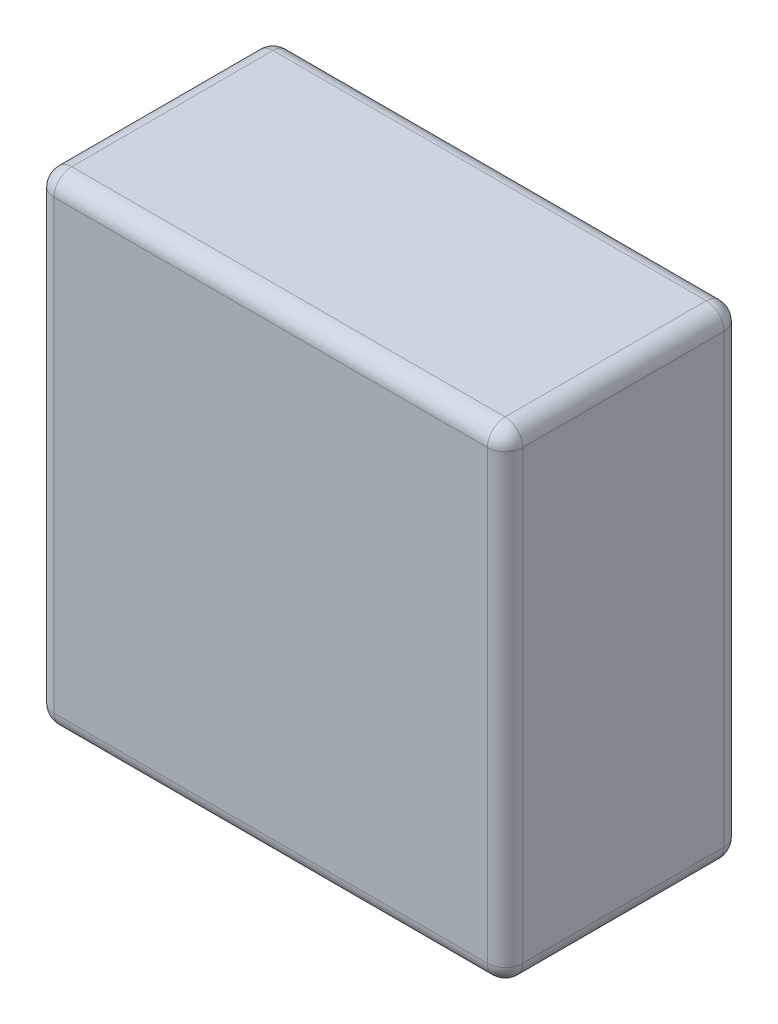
ISO-10303-21;
HEADER;
FILE_DESCRIPTION(('STEP AP214'),'2;1');
FILE_NAME('part.step','',(''),(''),'','','');
FILE_SCHEMA(('AUTOMOTIVE_DESIGN { 1 0 10303 214 1 1 1 1 }'));
ENDSEC;
DATA;
#1=APPLICATION_CONTEXT('core data for automotive mechanical design processes');
#2=APPLICATION_PROTOCOL_DEFINITION('international standard','automotive_design',2000,#1);
#3=PRODUCT_CONTEXT('',#1,'mechanical');
#4=PRODUCT('Part','Part','',(#3));
#5=PRODUCT_RELATED_PRODUCT_CATEGORY('part','',(#4));
#6=PRODUCT_DEFINITION_FORMATION('','',#4);
#7=PRODUCT_DEFINITION_CONTEXT('part definition',#1,'design');
#8=PRODUCT_DEFINITION('design','',#6,#7);
#9=PRODUCT_DEFINITION_SHAPE('','',#8);
#10=(LENGTH_UNIT() NAMED_UNIT(*) SI_UNIT(.MILLI.,.METRE.));
#11=(NAMED_UNIT(*) PLANE_ANGLE_UNIT() SI_UNIT($,.RADIAN.));
#12=(NAMED_UNIT(*) SI_UNIT($,.STERADIAN.) SOLID_ANGLE_UNIT());
#13=UNCERTAINTY_MEASURE_WITH_UNIT(LENGTH_MEASURE(1.E-05),#10,'distance_accuracy_value','');
#14=(GEOMETRIC_REPRESENTATION_CONTEXT(3) GLOBAL_UNCERTAINTY_ASSIGNED_CONTEXT((#13)) GLOBAL_UNIT_ASSIGNED_CONTEXT((#10,
#11,#12)) REPRESENTATION_CONTEXT('',''));
#15=CARTESIAN_POINT('',(0.,0.,0.));
#16=DIRECTION('',(0.,0.,1.));
#17=DIRECTION('',(1.,0.,0.));
#18=AXIS2_PLACEMENT_3D('',#15,#16,#17);
#19=CARTESIAN_POINT('',(341.,36.,106.));
#20=DIRECTION('',(1.,0.,0.));
#21=DIRECTION('',(0.,1.,0.));
#22=AXIS2_PLACEMENT_3D('',#19,#20,#21);
#23=SPHERICAL_SURFACE('',#22,4.);
#24=CARTESIAN_POINT('',(341.,36.,106.));
#25=DIRECTION('',(1.,0.,0.));
#26=DIRECTION('',(0.,0.,-1.));
#27=AXIS2_PLACEMENT_3D('',#24,#25,#26);
#28=CIRCLE('',#27,4.);
#29=CARTESIAN_POINT('',(341.,32.,106.));
#30=VERTEX_POINT('',#29);
#31=CARTESIAN_POINT('',(341.,35.9999999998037,102.));
#32=VERTEX_POINT('',#31);
#33=EDGE_CURVE('E120',#30,#32,#28,.T.);
#34=ORIENTED_EDGE('',*,*,#33,.F.);
#35=CARTESIAN_POINT('',(341.,36.,106.));
#36=DIRECTION('',(0.,0.,1.));
#37=DIRECTION('',(1.,0.,0.));
#38=AXIS2_PLACEMENT_3D('',#35,#36,#37);
#39=CIRCLE('',#38,4.);
#40=CARTESIAN_POINT('',(337.,36.,106.));
#41=VERTEX_POINT('',#40);
#42=EDGE_CURVE('E123',#41,#30,#39,.T.);
#43=ORIENTED_EDGE('',*,*,#42,.F.);
#44=CARTESIAN_POINT('',(341.,36.,106.));
#45=DIRECTION('',(0.,1.,0.));
#46=DIRECTION('',(1.,0.,0.));
#47=AXIS2_PLACEMENT_3D('',#44,#45,#46);
#48=CIRCLE('',#47,4.);
#49=EDGE_CURVE('E117',#32,#41,#48,.T.);
#50=ORIENTED_EDGE('',*,*,#49,.F.);
#51=EDGE_LOOP('',(#34,#43,#50));
#52=FACE_BOUND('',#51,.T.);
#53=ADVANCED_FACE('F16',(#52),#23,.T.);
#54=CARTESIAN_POINT('',(341.,36.,106.));
#55=DIRECTION('',(0.,1.,0.));
#56=DIRECTION('',(0.,0.,1.));
#57=AXIS2_PLACEMENT_3D('',#54,#55,#56);
#58=CYLINDRICAL_SURFACE('',#57,4.);
#59=DIRECTION('',(0.,1.,0.));
#60=VECTOR('',#59,1.);
#61=CARTESIAN_POINT('',(341.,86.5,102.));
#62=LINE('',#61,#60);
#63=CARTESIAN_POINT('',(341.,137.,102.));
#64=VERTEX_POINT('',#63);
#65=EDGE_CURVE('E129',#64,#32,#62,.F.);
#66=ORIENTED_EDGE('',*,*,#65,.T.);
#67=ORIENTED_EDGE('',*,*,#49,.T.);
#68=DIRECTION('',(0.,1.,0.));
#69=VECTOR('',#68,1.);
#70=CARTESIAN_POINT('',(337.,86.5,106.));
#71=LINE('',#70,#69);
#72=CARTESIAN_POINT('',(337.,137.,106.));
#73=VERTEX_POINT('',#72);
#74=EDGE_CURVE('E535',#41,#73,#71,.T.);
#75=ORIENTED_EDGE('',*,*,#74,.T.);
#76=CARTESIAN_POINT('',(341.,137.,106.));
#77=DIRECTION('',(0.,1.,0.));
#78=DIRECTION('',(1.,0.,0.));
#79=AXIS2_PLACEMENT_3D('',#76,#77,#78);
#80=CIRCLE('',#79,4.);
#81=EDGE_CURVE('E132',#64,#73,#80,.T.);
#82=ORIENTED_EDGE('',*,*,#81,.F.);
#83=EDGE_LOOP('',(#66,#67,#75,#82));
#84=FACE_BOUND('',#83,.T.);
#85=ADVANCED_FACE('F130',(#84),#58,.T.);
#86=CARTESIAN_POINT('',(341.,36.,106.));
#87=DIRECTION('',(1.,0.,0.));
#88=DIRECTION('',(0.,0.,-1.));
#89=AXIS2_PLACEMENT_3D('',#86,#87,#88);
#90=CYLINDRICAL_SURFACE('',#89,4.);
#91=DIRECTION('',(1.,0.,0.));
#92=VECTOR('',#91,1.);
#93=CARTESIAN_POINT('',(390.,36.,102.));
#94=LINE('',#93,#92);
#95=CARTESIAN_POINT('',(439.,36.,102.));
#96=VERTEX_POINT('',#95);
#97=EDGE_CURVE('E136',#32,#96,#94,.T.);
#98=ORIENTED_EDGE('',*,*,#97,.T.);
#99=CARTESIAN_POINT('',(439.,36.,106.));
#100=DIRECTION('',(1.,0.,0.));
#101=DIRECTION('',(0.,1.,0.));
#102=AXIS2_PLACEMENT_3D('',#99,#100,#101);
#103=CIRCLE('',#102,4.);
#104=CARTESIAN_POINT('',(439.,32.,106.));
#105=VERTEX_POINT('',#104);
#106=EDGE_CURVE('E137',#105,#96,#103,.T.);
#107=ORIENTED_EDGE('',*,*,#106,.F.);
#108=DIRECTION('',(1.,0.,0.));
#109=VECTOR('',#108,1.);
#110=CARTESIAN_POINT('',(390.,32.,106.));
#111=LINE('',#110,#109);
#112=EDGE_CURVE('E143',#105,#30,#111,.F.);
#113=ORIENTED_EDGE('',*,*,#112,.T.);
#114=ORIENTED_EDGE('',*,*,#33,.T.);
#115=EDGE_LOOP('',(#98,#107,#113,#114));
#116=FACE_BOUND('',#115,.T.);
#117=ADVANCED_FACE('F140',(#116),#90,.T.);
#118=CARTESIAN_POINT('',(341.,36.,106.));
#119=DIRECTION('',(0.,0.,1.));
#120=DIRECTION('',(1.,0.,0.));
#121=AXIS2_PLACEMENT_3D('',#118,#119,#120);
#122=CYLINDRICAL_SURFACE('',#121,4.);
#123=DIRECTION('',(0.,0.,1.));
#124=VECTOR('',#123,1.);
#125=CARTESIAN_POINT('',(341.,32.,128.75));
#126=LINE('',#125,#124);
#127=CARTESIAN_POINT('',(341.,32.,151.499999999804));
#128=VERTEX_POINT('',#127);
#129=EDGE_CURVE('E188',#30,#128,#126,.T.);
#130=ORIENTED_EDGE('',*,*,#129,.T.);
#131=CARTESIAN_POINT('',(341.,36.,151.5));
#132=DIRECTION('',(0.,3.92521448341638E-10,-1.));
#133=DIRECTION('',(1.,0.,0.));
#134=AXIS2_PLACEMENT_3D('',#131,#132,#133);
#135=CIRCLE('',#134,4.);
#136=CARTESIAN_POINT('',(337.,36.,151.5));
#137=VERTEX_POINT('',#136);
#138=EDGE_CURVE('E184',#137,#128,#135,.F.);
#139=ORIENTED_EDGE('',*,*,#138,.F.);
#140=DIRECTION('',(0.,0.,-1.));
#141=VECTOR('',#140,1.);
#142=CARTESIAN_POINT('',(337.,36.,128.75));
#143=LINE('',#142,#141);
#144=EDGE_CURVE('E151',#137,#41,#143,.T.);
#145=ORIENTED_EDGE('',*,*,#144,.T.);
#146=ORIENTED_EDGE('',*,*,#42,.T.);
#147=EDGE_LOOP('',(#130,#139,#145,#146));
#148=FACE_BOUND('',#147,.T.);
#149=ADVANCED_FACE('F351',(#148),#122,.T.);
#150=CARTESIAN_POINT('',(439.,36.,106.));
#151=DIRECTION('',(1.,0.,0.));
#152=DIRECTION('',(0.,1.,0.));
#153=AXIS2_PLACEMENT_3D('',#150,#151,#152);
#154=SPHERICAL_SURFACE('',#153,4.);
#155=CARTESIAN_POINT('',(439.,36.,106.));
#156=DIRECTION('',(0.,0.,1.));
#157=DIRECTION('',(1.,0.,0.));
#158=AXIS2_PLACEMENT_3D('',#155,#156,#157);
#159=CIRCLE('',#158,4.);
#160=CARTESIAN_POINT('',(443.,36.,106.));
#161=VERTEX_POINT('',#160);
#162=EDGE_CURVE('E189',#105,#161,#159,.T.);
#163=ORIENTED_EDGE('',*,*,#162,.F.);
#164=ORIENTED_EDGE('',*,*,#106,.T.);
#165=CARTESIAN_POINT('',(439.,36.,106.));
#166=DIRECTION('',(0.,1.,0.));
#167=DIRECTION('',(1.,0.,0.));
#168=AXIS2_PLACEMENT_3D('',#165,#166,#167);
#169=CIRCLE('',#168,4.);
#170=EDGE_CURVE('E192',#161,#96,#169,.T.);
#171=ORIENTED_EDGE('',*,*,#170,.F.);
#172=EDGE_LOOP('',(#163,#164,#171));
#173=FACE_BOUND('',#172,.T.);
#174=ADVANCED_FACE('F345',(#173),#154,.T.);
#175=CARTESIAN_POINT('',(390.,86.5,102.));
#176=DIRECTION('',(0.,0.,1.));
#177=DIRECTION('',(1.,0.,0.));
#178=AXIS2_PLACEMENT_3D('',#175,#176,#177);
#179=PLANE('',#178);
#180=ORIENTED_EDGE('',*,*,#97,.F.);
#181=ORIENTED_EDGE('',*,*,#65,.F.);
#182=DIRECTION('',(1.,0.,0.));
#183=VECTOR('',#182,1.);
#184=CARTESIAN_POINT('',(390.,137.,102.));
#185=LINE('',#184,#183);
#186=CARTESIAN_POINT('',(439.,137.,102.));
#187=VERTEX_POINT('',#186);
#188=EDGE_CURVE('E196',#187,#64,#185,.F.);
#189=ORIENTED_EDGE('',*,*,#188,.F.);
#190=DIRECTION('',(0.,1.,0.));
#191=VECTOR('',#190,1.);
#192=CARTESIAN_POINT('',(439.,86.5,102.));
#193=LINE('',#192,#191);
#194=EDGE_CURVE('E148',#96,#187,#193,.T.);
#195=ORIENTED_EDGE('',*,*,#194,.F.);
#196=EDGE_LOOP('',(#180,#181,#189,#195));
#197=FACE_BOUND('',#196,.T.);
#198=ADVANCED_FACE('F146',(#197),#179,.F.);
#199=CARTESIAN_POINT('',(341.,137.,106.));
#200=DIRECTION('',(1.,0.,0.));
#201=DIRECTION('',(0.,1.,0.));
#202=AXIS2_PLACEMENT_3D('',#199,#200,#201);
#203=SPHERICAL_SURFACE('',#202,4.);
#204=CARTESIAN_POINT('',(341.,137.,106.));
#205=DIRECTION('',(0.,0.,1.));
#206=DIRECTION('',(1.,0.,0.));
#207=AXIS2_PLACEMENT_3D('',#204,#205,#206);
#208=CIRCLE('',#207,4.);
#209=CARTESIAN_POINT('',(341.,141.,106.));
#210=VERTEX_POINT('',#209);
#211=EDGE_CURVE('E204',#210,#73,#208,.T.);
#212=ORIENTED_EDGE('',*,*,#211,.F.);
#213=CARTESIAN_POINT('',(341.,137.,106.));
#214=DIRECTION('',(1.,0.,0.));
#215=DIRECTION('',(0.,0.,-1.));
#216=AXIS2_PLACEMENT_3D('',#213,#214,#215);
#217=CIRCLE('',#216,4.);
#218=EDGE_CURVE('E198',#64,#210,#217,.T.);
#219=ORIENTED_EDGE('',*,*,#218,.F.);
#220=ORIENTED_EDGE('',*,*,#81,.T.);
#221=EDGE_LOOP('',(#212,#219,#220));
#222=FACE_BOUND('',#221,.T.);
#223=ADVANCED_FACE('F159',(#222),#203,.T.);
#224=CARTESIAN_POINT('',(337.,86.5,128.75));
#225=DIRECTION('',(1.,0.,0.));
#226=DIRECTION('',(0.,0.,-1.));
#227=AXIS2_PLACEMENT_3D('',#224,#225,#226);
#228=PLANE('',#227);
#229=ORIENTED_EDGE('',*,*,#74,.F.);
#230=ORIENTED_EDGE('',*,*,#144,.F.);
#231=DIRECTION('',(0.,1.,0.));
#232=VECTOR('',#231,1.);
#233=CARTESIAN_POINT('',(337.,86.5,151.5));
#234=LINE('',#233,#232);
#235=CARTESIAN_POINT('',(337.,137.,151.5));
#236=VERTEX_POINT('',#235);
#237=EDGE_CURVE('E207',#236,#137,#234,.F.);
#238=ORIENTED_EDGE('',*,*,#237,.F.);
#239=DIRECTION('',(0.,0.,1.));
#240=VECTOR('',#239,1.);
#241=CARTESIAN_POINT('',(337.,137.,128.75));
#242=LINE('',#241,#240);
#243=EDGE_CURVE('E201',#73,#236,#242,.T.);
#244=ORIENTED_EDGE('',*,*,#243,.F.);
#245=EDGE_LOOP('',(#229,#230,#238,#244));
#246=FACE_BOUND('',#245,.T.);
#247=ADVANCED_FACE('F163',(#246),#228,.F.);
#248=CARTESIAN_POINT('',(390.,32.,128.75));
#249=DIRECTION('',(0.,1.,0.));
#250=DIRECTION('',(0.,0.,1.));
#251=AXIS2_PLACEMENT_3D('',#248,#249,#250);
#252=PLANE('',#251);
#253=ORIENTED_EDGE('',*,*,#112,.F.);
#254=DIRECTION('',(0.,0.,1.));
#255=VECTOR('',#254,1.);
#256=CARTESIAN_POINT('',(439.,32.,128.75));
#257=LINE('',#256,#255);
#258=CARTESIAN_POINT('',(439.,32.,151.5));
#259=VERTEX_POINT('',#258);
#260=EDGE_CURVE('E187',#259,#105,#257,.F.);
#261=ORIENTED_EDGE('',*,*,#260,.F.);
#262=DIRECTION('',(1.,0.,0.));
#263=VECTOR('',#262,1.);
#264=CARTESIAN_POINT('',(390.,32.,151.5));
#265=LINE('',#264,#263);
#266=EDGE_CURVE('E212',#128,#259,#265,.T.);
#267=ORIENTED_EDGE('',*,*,#266,.F.);
#268=ORIENTED_EDGE('',*,*,#129,.F.);
#269=EDGE_LOOP('',(#253,#261,#267,#268));
#270=FACE_BOUND('',#269,.T.);
#271=ADVANCED_FACE('F168',(#270),#252,.F.);
#272=CARTESIAN_POINT('',(341.,36.,151.5));
#273=DIRECTION('',(1.,0.,0.));
#274=DIRECTION('',(0.,1.,0.));
#275=AXIS2_PLACEMENT_3D('',#272,#273,#274);
#276=SPHERICAL_SURFACE('',#275,4.);
#277=ORIENTED_EDGE('',*,*,#138,.T.);
#278=CARTESIAN_POINT('',(341.,36.,151.5));
#279=DIRECTION('',(1.,0.,0.));
#280=DIRECTION('',(0.,0.,-1.));
#281=AXIS2_PLACEMENT_3D('',#278,#279,#280);
#282=CIRCLE('',#281,4.);
#283=CARTESIAN_POINT('',(341.,36.,155.5));
#284=VERTEX_POINT('',#283);
#285=EDGE_CURVE('E215',#284,#128,#282,.T.);
#286=ORIENTED_EDGE('',*,*,#285,.F.);
#287=CARTESIAN_POINT('',(341.,36.,151.5));
#288=DIRECTION('',(0.,1.,0.));
#289=DIRECTION('',(1.,0.,0.));
#290=AXIS2_PLACEMENT_3D('',#287,#288,#289);
#291=CIRCLE('',#290,4.);
#292=EDGE_CURVE('E210',#137,#284,#291,.T.);
#293=ORIENTED_EDGE('',*,*,#292,.F.);
#294=EDGE_LOOP('',(#277,#286,#293));
#295=FACE_BOUND('',#294,.T.);
#296=ADVANCED_FACE('F172',(#295),#276,.T.);
#297=CARTESIAN_POINT('',(439.,36.,106.));
#298=DIRECTION('',(0.,0.,1.));
#299=DIRECTION('',(1.,0.,0.));
#300=AXIS2_PLACEMENT_3D('',#297,#298,#299);
#301=CYLINDRICAL_SURFACE('',#300,4.);
#302=DIRECTION('',(0.,0.,1.));
#303=VECTOR('',#302,1.);
#304=CARTESIAN_POINT('',(443.,36.,128.75));
#305=LINE('',#304,#303);
#306=CARTESIAN_POINT('',(443.,36.,151.5));
#307=VERTEX_POINT('',#306);
#308=EDGE_CURVE('E256',#161,#307,#305,.T.);
#309=ORIENTED_EDGE('',*,*,#308,.T.);
#310=CARTESIAN_POINT('',(439.,36.,151.5));
#311=DIRECTION('',(0.,0.,-1.));
#312=DIRECTION('',(1.,0.,0.));
#313=AXIS2_PLACEMENT_3D('',#310,#311,#312);
#314=CIRCLE('',#313,4.);
#315=EDGE_CURVE('E223',#259,#307,#314,.F.);
#316=ORIENTED_EDGE('',*,*,#315,.F.);
#317=ORIENTED_EDGE('',*,*,#260,.T.);
#318=ORIENTED_EDGE('',*,*,#162,.T.);
#319=EDGE_LOOP('',(#309,#316,#317,#318));
#320=FACE_BOUND('',#319,.T.);
#321=ADVANCED_FACE('F177',(#320),#301,.T.);
#322=CARTESIAN_POINT('',(439.,36.,106.));
#323=DIRECTION('',(0.,1.,0.));
#324=DIRECTION('',(0.,0.,1.));
#325=AXIS2_PLACEMENT_3D('',#322,#323,#324);
#326=CYLINDRICAL_SURFACE('',#325,4.);
#327=ORIENTED_EDGE('',*,*,#194,.T.);
#328=CARTESIAN_POINT('',(439.,137.,106.));
#329=DIRECTION('',(0.,1.,0.));
#330=DIRECTION('',(1.,0.,0.));
#331=AXIS2_PLACEMENT_3D('',#328,#329,#330);
#332=CIRCLE('',#331,4.);
#333=CARTESIAN_POINT('',(443.,137.,106.));
#334=VERTEX_POINT('',#333);
#335=EDGE_CURVE('E253',#334,#187,#332,.T.);
#336=ORIENTED_EDGE('',*,*,#335,.F.);
#337=DIRECTION('',(0.,1.,0.));
#338=VECTOR('',#337,1.);
#339=CARTESIAN_POINT('',(443.,86.5,106.));
#340=LINE('',#339,#338);
#341=EDGE_CURVE('E247',#334,#161,#340,.F.);
#342=ORIENTED_EDGE('',*,*,#341,.T.);
#343=ORIENTED_EDGE('',*,*,#170,.T.);
#344=EDGE_LOOP('',(#327,#336,#342,#343));
#345=FACE_BOUND('',#344,.T.);
#346=ADVANCED_FACE('F331',(#345),#326,.T.);
#347=CARTESIAN_POINT('',(341.,137.,106.));
#348=DIRECTION('',(1.,0.,0.));
#349=DIRECTION('',(0.,0.,-1.));
#350=AXIS2_PLACEMENT_3D('',#347,#348,#349);
#351=CYLINDRICAL_SURFACE('',#350,4.);
#352=ORIENTED_EDGE('',*,*,#188,.T.);
#353=ORIENTED_EDGE('',*,*,#218,.T.);
#354=DIRECTION('',(1.,0.,0.));
#355=VECTOR('',#354,1.);
#356=CARTESIAN_POINT('',(390.,141.,106.));
#357=LINE('',#356,#355);
#358=CARTESIAN_POINT('',(439.,141.,106.));
#359=VERTEX_POINT('',#358);
#360=EDGE_CURVE('E257',#210,#359,#357,.T.);
#361=ORIENTED_EDGE('',*,*,#360,.T.);
#362=CARTESIAN_POINT('',(439.,137.,106.));
#363=DIRECTION('',(1.,0.,0.));
#364=DIRECTION('',(0.,1.,0.));
#365=AXIS2_PLACEMENT_3D('',#362,#363,#364);
#366=CIRCLE('',#365,4.);
#367=EDGE_CURVE('E249',#187,#359,#366,.T.);
#368=ORIENTED_EDGE('',*,*,#367,.F.);
#369=EDGE_LOOP('',(#352,#353,#361,#368));
#370=FACE_BOUND('',#369,.T.);
#371=ADVANCED_FACE('F326',(#370),#351,.T.);
#372=CARTESIAN_POINT('',(341.,137.,106.));
#373=DIRECTION('',(0.,0.,1.));
#374=DIRECTION('',(1.,0.,0.));
#375=AXIS2_PLACEMENT_3D('',#372,#373,#374);
#376=CYLINDRICAL_SURFACE('',#375,4.);
#377=DIRECTION('',(0.,0.,-1.));
#378=VECTOR('',#377,1.);
#379=CARTESIAN_POINT('',(341.,141.,128.75));
#380=LINE('',#379,#378);
#381=CARTESIAN_POINT('',(341.,141.,151.5));
#382=VERTEX_POINT('',#381);
#383=EDGE_CURVE('E252',#382,#210,#380,.T.);
#384=ORIENTED_EDGE('',*,*,#383,.T.);
#385=ORIENTED_EDGE('',*,*,#211,.T.);
#386=ORIENTED_EDGE('',*,*,#243,.T.);
#387=CARTESIAN_POINT('',(341.,137.,151.5));
#388=DIRECTION('',(0.,0.,1.));
#389=DIRECTION('',(1.,0.,0.));
#390=AXIS2_PLACEMENT_3D('',#387,#388,#389);
#391=CIRCLE('',#390,4.);
#392=EDGE_CURVE('E264',#382,#236,#391,.T.);
#393=ORIENTED_EDGE('',*,*,#392,.F.);
#394=EDGE_LOOP('',(#384,#385,#386,#393));
#395=FACE_BOUND('',#394,.T.);
#396=ADVANCED_FACE('F321',(#395),#376,.T.);
#397=CARTESIAN_POINT('',(341.,36.,151.5));
#398=DIRECTION('',(0.,1.,0.));
#399=DIRECTION('',(0.,0.,1.));
#400=AXIS2_PLACEMENT_3D('',#397,#398,#399);
#401=CYLINDRICAL_SURFACE('',#400,4.);
#402=DIRECTION('',(0.,1.,0.));
#403=VECTOR('',#402,1.);
#404=CARTESIAN_POINT('',(341.,86.5,155.5));
#405=LINE('',#404,#403);
#406=CARTESIAN_POINT('',(341.,137.,155.5));
#407=VERTEX_POINT('',#406);
#408=EDGE_CURVE('E55',#407,#284,#405,.F.);
#409=ORIENTED_EDGE('',*,*,#408,.F.);
#410=CARTESIAN_POINT('',(341.,137.,151.5));
#411=DIRECTION('',(0.,-1.,0.));
#412=DIRECTION('',(1.,0.,0.));
#413=AXIS2_PLACEMENT_3D('',#410,#411,#412);
#414=CIRCLE('',#413,4.);
#415=EDGE_CURVE('E259',#236,#407,#414,.F.);
#416=ORIENTED_EDGE('',*,*,#415,.F.);
#417=ORIENTED_EDGE('',*,*,#237,.T.);
#418=ORIENTED_EDGE('',*,*,#292,.T.);
#419=EDGE_LOOP('',(#409,#416,#417,#418));
#420=FACE_BOUND('',#419,.T.);
#421=ADVANCED_FACE('F440',(#420),#401,.T.);
#422=CARTESIAN_POINT('',(341.,36.,151.5));
#423=DIRECTION('',(1.,0.,0.));
#424=DIRECTION('',(0.,0.,-1.));
#425=AXIS2_PLACEMENT_3D('',#422,#423,#424);
#426=CYLINDRICAL_SURFACE('',#425,4.);
#427=DIRECTION('',(1.,0.,0.));
#428=VECTOR('',#427,1.);
#429=CARTESIAN_POINT('',(390.,36.,155.5));
#430=LINE('',#429,#428);
#431=CARTESIAN_POINT('',(439.,35.9999999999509,155.5));
#432=VERTEX_POINT('',#431);
#433=EDGE_CURVE('E314',#284,#432,#430,.T.);
#434=ORIENTED_EDGE('',*,*,#433,.F.);
#435=ORIENTED_EDGE('',*,*,#285,.T.);
#436=ORIENTED_EDGE('',*,*,#266,.T.);
#437=CARTESIAN_POINT('',(439.,36.,151.5));
#438=DIRECTION('',(1.,0.,0.));
#439=DIRECTION('',(0.,1.,0.));
#440=AXIS2_PLACEMENT_3D('',#437,#438,#439);
#441=CIRCLE('',#440,4.);
#442=EDGE_CURVE('E218',#432,#259,#441,.T.);
#443=ORIENTED_EDGE('',*,*,#442,.F.);
#444=EDGE_LOOP('',(#434,#435,#436,#443));
#445=FACE_BOUND('',#444,.T.);
#446=ADVANCED_FACE('F231',(#445),#426,.T.);
#447=CARTESIAN_POINT('',(439.,36.,151.5));
#448=DIRECTION('',(1.,0.,0.));
#449=DIRECTION('',(0.,1.,0.));
#450=AXIS2_PLACEMENT_3D('',#447,#448,#449);
#451=SPHERICAL_SURFACE('',#450,4.);
#452=ORIENTED_EDGE('',*,*,#442,.T.);
#453=ORIENTED_EDGE('',*,*,#315,.T.);
#454=CARTESIAN_POINT('',(439.,36.,151.5));
#455=DIRECTION('',(0.,1.,0.));
#456=DIRECTION('',(1.,0.,0.));
#457=AXIS2_PLACEMENT_3D('',#454,#455,#456);
#458=CIRCLE('',#457,4.);
#459=EDGE_CURVE('E307',#432,#307,#458,.T.);
#460=ORIENTED_EDGE('',*,*,#459,.F.);
#461=EDGE_LOOP('',(#452,#453,#460));
#462=FACE_BOUND('',#461,.T.);
#463=ADVANCED_FACE('F226',(#462),#451,.T.);
#464=CARTESIAN_POINT('',(443.,86.5,128.75));
#465=DIRECTION('',(-1.,0.,0.));
#466=DIRECTION('',(0.,0.,1.));
#467=AXIS2_PLACEMENT_3D('',#464,#465,#466);
#468=PLANE('',#467);
#469=ORIENTED_EDGE('',*,*,#341,.F.);
#470=DIRECTION('',(0.,0.,1.));
#471=VECTOR('',#470,1.);
#472=CARTESIAN_POINT('',(443.,137.,128.75));
#473=LINE('',#472,#471);
#474=CARTESIAN_POINT('',(443.,137.,151.5));
#475=VERTEX_POINT('',#474);
#476=EDGE_CURVE('E304',#475,#334,#473,.F.);
#477=ORIENTED_EDGE('',*,*,#476,.F.);
#478=DIRECTION('',(0.,1.,0.));
#479=VECTOR('',#478,1.);
#480=CARTESIAN_POINT('',(443.,86.5,151.5));
#481=LINE('',#480,#479);
#482=EDGE_CURVE('E311',#307,#475,#481,.T.);
#483=ORIENTED_EDGE('',*,*,#482,.F.);
#484=ORIENTED_EDGE('',*,*,#308,.F.);
#485=EDGE_LOOP('',(#469,#477,#483,#484));
#486=FACE_BOUND('',#485,.T.);
#487=ADVANCED_FACE('F230',(#486),#468,.F.);
#488=CARTESIAN_POINT('',(439.,137.,106.));
#489=DIRECTION('',(1.,0.,0.));
#490=DIRECTION('',(0.,1.,0.));
#491=AXIS2_PLACEMENT_3D('',#488,#489,#490);
#492=SPHERICAL_SURFACE('',#491,4.);
#493=ORIENTED_EDGE('',*,*,#367,.T.);
#494=CARTESIAN_POINT('',(439.,137.,106.));
#495=DIRECTION('',(0.,0.,1.));
#496=DIRECTION('',(1.,0.,0.));
#497=AXIS2_PLACEMENT_3D('',#494,#495,#496);
#498=CIRCLE('',#497,4.);
#499=EDGE_CURVE('E306',#334,#359,#498,.T.);
#500=ORIENTED_EDGE('',*,*,#499,.F.);
#501=ORIENTED_EDGE('',*,*,#335,.T.);
#502=EDGE_LOOP('',(#493,#500,#501));
#503=FACE_BOUND('',#502,.T.);
#504=ADVANCED_FACE('F236',(#503),#492,.T.);
#505=CARTESIAN_POINT('',(390.,141.,128.75));
#506=DIRECTION('',(0.,-1.,0.));
#507=DIRECTION('',(0.,0.,-1.));
#508=AXIS2_PLACEMENT_3D('',#505,#506,#507);
#509=PLANE('',#508);
#510=ORIENTED_EDGE('',*,*,#360,.F.);
#511=ORIENTED_EDGE('',*,*,#383,.F.);
#512=DIRECTION('',(1.,0.,0.));
#513=VECTOR('',#512,1.);
#514=CARTESIAN_POINT('',(390.,141.,151.5));
#515=LINE('',#514,#513);
#516=CARTESIAN_POINT('',(439.,141.,151.5));
#517=VERTEX_POINT('',#516);
#518=EDGE_CURVE('E35',#517,#382,#515,.F.);
#519=ORIENTED_EDGE('',*,*,#518,.F.);
#520=DIRECTION('',(0.,0.,1.));
#521=VECTOR('',#520,1.);
#522=CARTESIAN_POINT('',(439.,141.,128.75));
#523=LINE('',#522,#521);
#524=EDGE_CURVE('E302',#359,#517,#523,.T.);
#525=ORIENTED_EDGE('',*,*,#524,.F.);
#526=EDGE_LOOP('',(#510,#511,#519,#525));
#527=FACE_BOUND('',#526,.T.);
#528=ADVANCED_FACE('F241',(#527),#509,.F.);
#529=CARTESIAN_POINT('',(341.,137.,151.5));
#530=DIRECTION('',(1.,0.,0.));
#531=DIRECTION('',(0.,1.,0.));
#532=AXIS2_PLACEMENT_3D('',#529,#530,#531);
#533=SPHERICAL_SURFACE('',#532,4.);
#534=CARTESIAN_POINT('',(341.,137.,151.5));
#535=DIRECTION('',(1.,0.,0.));
#536=DIRECTION('',(0.,0.,-1.));
#537=AXIS2_PLACEMENT_3D('',#534,#535,#536);
#538=CIRCLE('',#537,4.);
#539=EDGE_CURVE('E294',#382,#407,#538,.T.);
#540=ORIENTED_EDGE('',*,*,#539,.F.);
#541=ORIENTED_EDGE('',*,*,#392,.T.);
#542=ORIENTED_EDGE('',*,*,#415,.T.);
#543=EDGE_LOOP('',(#540,#541,#542));
#544=FACE_BOUND('',#543,.T.);
#545=ADVANCED_FACE('F266',(#544),#533,.T.);
#546=CARTESIAN_POINT('',(390.,86.5,155.5));
#547=DIRECTION('',(0.,0.,1.));
#548=DIRECTION('',(1.,0.,0.));
#549=AXIS2_PLACEMENT_3D('',#546,#547,#548);
#550=PLANE('',#549);
#551=ORIENTED_EDGE('',*,*,#408,.T.);
#552=ORIENTED_EDGE('',*,*,#433,.T.);
#553=DIRECTION('',(0.,1.,0.));
#554=VECTOR('',#553,1.);
#555=CARTESIAN_POINT('',(439.,86.5,155.5));
#556=LINE('',#555,#554);
#557=CARTESIAN_POINT('',(439.,137.,155.5));
#558=VERTEX_POINT('',#557);
#559=EDGE_CURVE('E48',#558,#432,#556,.F.);
#560=ORIENTED_EDGE('',*,*,#559,.F.);
#561=DIRECTION('',(1.,0.,0.));
#562=VECTOR('',#561,1.);
#563=CARTESIAN_POINT('',(390.,137.,155.5));
#564=LINE('',#563,#562);
#565=EDGE_CURVE('E291',#407,#558,#564,.T.);
#566=ORIENTED_EDGE('',*,*,#565,.F.);
#567=EDGE_LOOP('',(#551,#552,#560,#566));
#568=FACE_BOUND('',#567,.T.);
#569=ADVANCED_FACE('F269',(#568),#550,.T.);
#570=CARTESIAN_POINT('',(439.,36.,151.5));
#571=DIRECTION('',(0.,1.,0.));
#572=DIRECTION('',(0.,0.,1.));
#573=AXIS2_PLACEMENT_3D('',#570,#571,#572);
#574=CYLINDRICAL_SURFACE('',#573,4.);
#575=ORIENTED_EDGE('',*,*,#559,.T.);
#576=ORIENTED_EDGE('',*,*,#459,.T.);
#577=ORIENTED_EDGE('',*,*,#482,.T.);
#578=CARTESIAN_POINT('',(439.,137.,151.5));
#579=DIRECTION('',(0.,-1.,0.));
#580=DIRECTION('',(1.,0.,0.));
#581=AXIS2_PLACEMENT_3D('',#578,#579,#580);
#582=CIRCLE('',#581,4.);
#583=EDGE_CURVE('E21',#558,#475,#582,.F.);
#584=ORIENTED_EDGE('',*,*,#583,.F.);
#585=EDGE_LOOP('',(#575,#576,#577,#584));
#586=FACE_BOUND('',#585,.T.);
#587=ADVANCED_FACE('F273',(#586),#574,.T.);
#588=CARTESIAN_POINT('',(439.,137.,106.));
#589=DIRECTION('',(0.,0.,1.));
#590=DIRECTION('',(1.,0.,0.));
#591=AXIS2_PLACEMENT_3D('',#588,#589,#590);
#592=CYLINDRICAL_SURFACE('',#591,4.);
#593=ORIENTED_EDGE('',*,*,#524,.T.);
#594=CARTESIAN_POINT('',(439.,137.,151.5));
#595=DIRECTION('',(0.,0.,1.));
#596=DIRECTION('',(1.,0.,0.));
#597=AXIS2_PLACEMENT_3D('',#594,#595,#596);
#598=CIRCLE('',#597,4.);
#599=EDGE_CURVE('E27',#475,#517,#598,.T.);
#600=ORIENTED_EDGE('',*,*,#599,.F.);
#601=ORIENTED_EDGE('',*,*,#476,.T.);
#602=ORIENTED_EDGE('',*,*,#499,.T.);
#603=EDGE_LOOP('',(#593,#600,#601,#602));
#604=FACE_BOUND('',#603,.T.);
#605=ADVANCED_FACE('F276',(#604),#592,.T.);
#606=CARTESIAN_POINT('',(341.,137.,151.5));
#607=DIRECTION('',(1.,0.,0.));
#608=DIRECTION('',(0.,0.,-1.));
#609=AXIS2_PLACEMENT_3D('',#606,#607,#608);
#610=CYLINDRICAL_SURFACE('',#609,4.);
#611=ORIENTED_EDGE('',*,*,#565,.T.);
#612=CARTESIAN_POINT('',(439.,137.,151.5));
#613=DIRECTION('',(1.,0.,0.));
#614=DIRECTION('',(0.,1.,0.));
#615=AXIS2_PLACEMENT_3D('',#612,#613,#614);
#616=CIRCLE('',#615,4.);
#617=EDGE_CURVE('E11',#517,#558,#616,.T.);
#618=ORIENTED_EDGE('',*,*,#617,.F.);
#619=ORIENTED_EDGE('',*,*,#518,.T.);
#620=ORIENTED_EDGE('',*,*,#539,.T.);
#621=EDGE_LOOP('',(#611,#618,#619,#620));
#622=FACE_BOUND('',#621,.T.);
#623=ADVANCED_FACE('F279',(#622),#610,.T.);
#624=CARTESIAN_POINT('',(439.,137.,151.5));
#625=DIRECTION('',(1.,0.,0.));
#626=DIRECTION('',(0.,1.,0.));
#627=AXIS2_PLACEMENT_3D('',#624,#625,#626);
#628=SPHERICAL_SURFACE('',#627,4.);
#629=ORIENTED_EDGE('',*,*,#599,.T.);
#630=ORIENTED_EDGE('',*,*,#617,.T.);
#631=ORIENTED_EDGE('',*,*,#583,.T.);
#632=EDGE_LOOP('',(#629,#630,#631));
#633=FACE_BOUND('',#632,.T.);
#634=ADVANCED_FACE('F18',(#633),#628,.T.);
#635=CLOSED_SHELL('',(#53,#85,#117,#149,#174,#198,#223,#247,#271,#296,#321,#346,#371,#396,#421,
#446,#463,#487,#504,#528,#545,#569,#587,#605,#623,#634));
#636=MANIFOLD_SOLID_BREP('B1',#635);
#637=ADVANCED_BREP_SHAPE_REPRESENTATION('',(#18,#636),#14);
#638=SHAPE_DEFINITION_REPRESENTATION(#9,#637);
ENDSEC;
END-ISO-10303-21;
